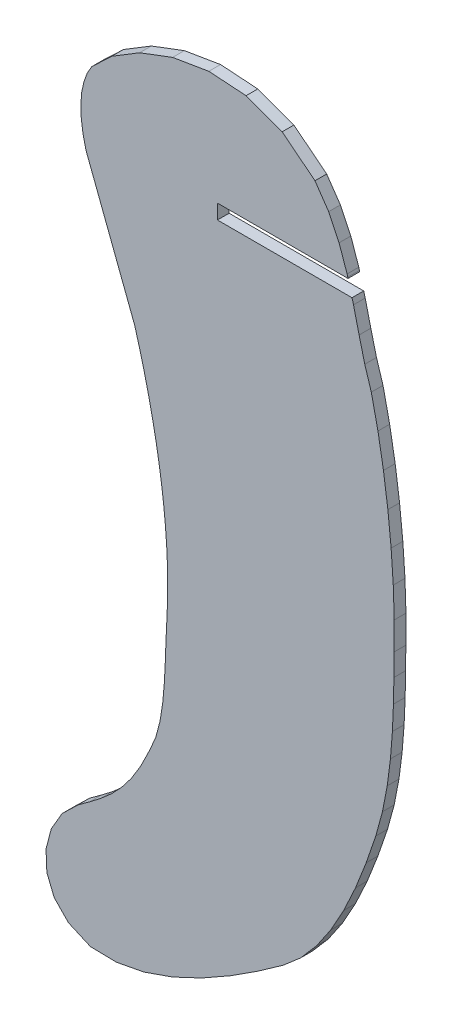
from build123d import *

# Parameters (mm, degrees)
EXTRUDE_1_DEPTH = 2


with BuildPart() as part:
    # Model → Extrude 1 (new body)
    with BuildSketch(Plane.XY):
        Polygon((-5730.1433, 33.3463), (-5730.2722, 36.082), (-5730.4781, 38.869), (-5730.76, 41.7033), (-5731.1165, 44.5811), (-5731.5559, 47.5547), (-5732.0706, 50.5647), (-5732.6597, 53.6068), (-5733.322, 56.6767), (-5734.0564, 59.77), (-5734.8618, 62.8825), (-5735.7368, 66.0098), (-5744.0505, 87.7221), (-5744.5685, 89.955), (-5744.8594, 92.0816), (-5744.9277, 94.0866), (-5744.7791, 95.9551), (-5744.418, 97.6716), (-5743.8494, 99.221), (-5743.0781, 100.588), (-5739.6255, 103.8516), (-5734.8955, 106.7323), (-5729.2559, 108.8697), (-5723.0735, 109.9029), (-5716.7163, 109.472), (-5710.5513, 107.216), (-5704.9459, 102.7748), (-5702.6106, 99.3804), (-5700.83, 95.6608), (-5699.4635, 91.7341), (-5699.349, 91.3135), (-5699.3026, 91.1428), (-5721.6055, 91.1428), (-5721.6055, 90.8928), (-5721.6055, 88.8928), (-5721.6055, 88.6428), (-5698.6222, 88.6428), (-5698.3706, 87.7185), (-5697.4106, 83.7319), (-5696.4434, 79.8927), (-5695.3276, 76.3192), (-5694.1934, 71.1404), (-5693.2507, 65.7874), (-5692.5005, 60.3582), (-5691.943, 54.9503), (-5691.5789, 49.6622), (-5691.4089, 44.5917), (-5691.4333, 39.8372), (-5691.4697, 36.0481), (-5691.5485, 32.063), (-5691.7263, 27.9349), (-5692.0598, 23.7169), (-5692.6061, 19.4622), (-5693.4216, 15.224), (-5694.5632, 11.0555), (-5696.2051, 6.2693), (-5698.0206, 1.6706), (-5700.0291, -2.6678), (-5702.25, -6.6736), (-5704.7029, -10.274), (-5707.4072, -13.3965), (-5710.3821, -15.9683), (-5714.7405, -19.034), (-5719.4209, -22.0456), (-5724.2991, -24.8138), (-5729.2507, -27.1491), (-5734.1514, -28.862), (-5738.8767, -29.7634), (-5743.302, -29.6635), (-5747.0359, -28.0212), (-5749.4876, -25.511), (-5750.7401, -22.4138), (-5750.8771, -19.0106), (-5749.9813, -15.5826), (-5748.1363, -12.411), (-5745.4249, -9.7765), (-5743.4102, -8.3056), (-5741.5103, -6.8437), (-5739.709, -5.272), (-5737.9895, -3.4725), (-5736.3352, -1.3262), (-5734.7295, 1.285), (-5733.1559, 4.48), (-5732.1206, 6.9024), (-5731.4089, 9.6089), (-5730.9502, 12.5448), (-5730.6738, 15.6553), (-5730.5085, 18.8861), (-5730.3838, 22.1823), (-5730.2285, 25.4895), (-5730.1204, 28.0461), (-5730.0923, 30.6663), align=None)
    extrude(amount=EXTRUDE_1_DEPTH)


solid = part.part
